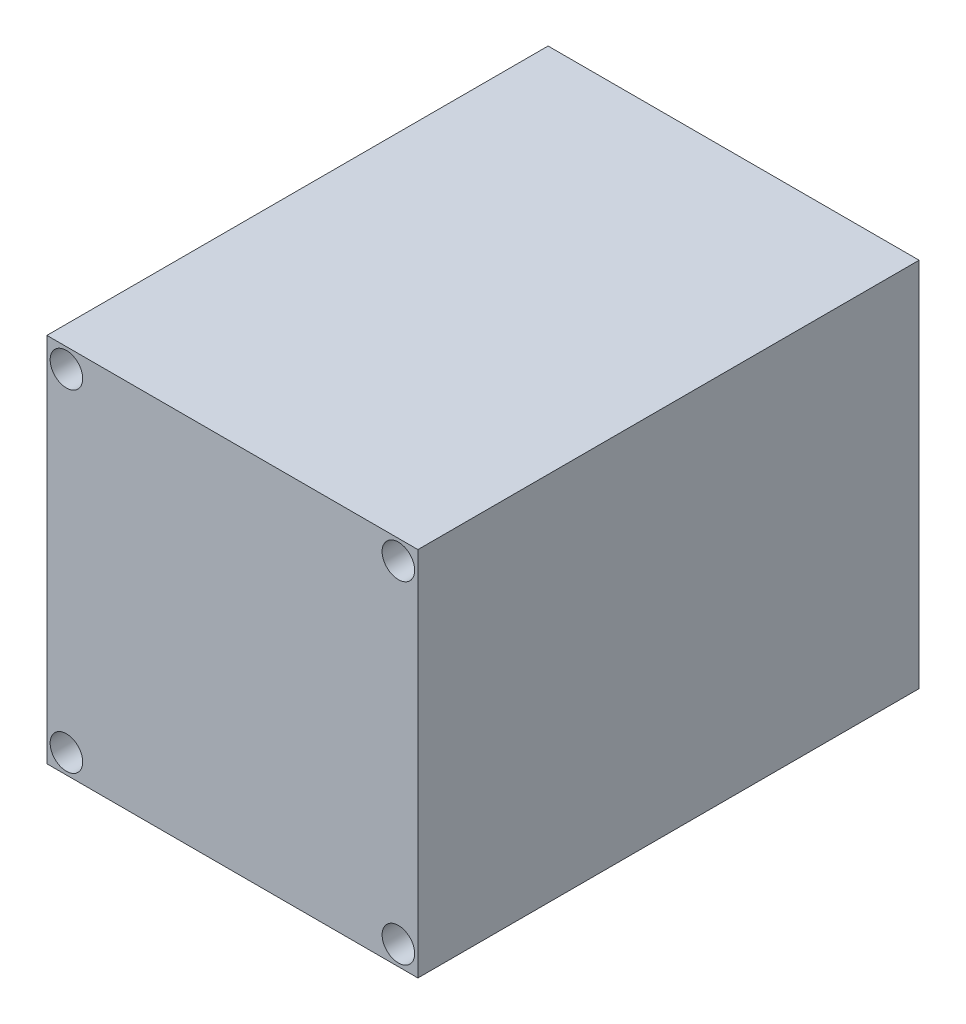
ISO-10303-21;
HEADER;
FILE_DESCRIPTION(('STEP AP214'),'2;1');
FILE_NAME('part.step','',(''),(''),'','','');
FILE_SCHEMA(('AUTOMOTIVE_DESIGN { 1 0 10303 214 1 1 1 1 }'));
ENDSEC;
DATA;
#1=APPLICATION_CONTEXT('core data for automotive mechanical design processes');
#2=APPLICATION_PROTOCOL_DEFINITION('international standard','automotive_design',2000,#1);
#3=PRODUCT_CONTEXT('',#1,'mechanical');
#4=PRODUCT('Part','Part','',(#3));
#5=PRODUCT_RELATED_PRODUCT_CATEGORY('part','',(#4));
#6=PRODUCT_DEFINITION_FORMATION('','',#4);
#7=PRODUCT_DEFINITION_CONTEXT('part definition',#1,'design');
#8=PRODUCT_DEFINITION('design','',#6,#7);
#9=PRODUCT_DEFINITION_SHAPE('','',#8);
#10=(LENGTH_UNIT() NAMED_UNIT(*) SI_UNIT(.MILLI.,.METRE.));
#11=(NAMED_UNIT(*) PLANE_ANGLE_UNIT() SI_UNIT($,.RADIAN.));
#12=(NAMED_UNIT(*) SI_UNIT($,.STERADIAN.) SOLID_ANGLE_UNIT());
#13=UNCERTAINTY_MEASURE_WITH_UNIT(LENGTH_MEASURE(1.E-05),#10,'distance_accuracy_value','');
#14=(GEOMETRIC_REPRESENTATION_CONTEXT(3) GLOBAL_UNCERTAINTY_ASSIGNED_CONTEXT((#13)) GLOBAL_UNIT_ASSIGNED_CONTEXT((#10,
#11,#12)) REPRESENTATION_CONTEXT('',''));
#15=CARTESIAN_POINT('',(0.,0.,0.));
#16=DIRECTION('',(0.,0.,1.));
#17=DIRECTION('',(1.,0.,0.));
#18=AXIS2_PLACEMENT_3D('',#15,#16,#17);
#19=CARTESIAN_POINT('',(0.,0.,77.));
#20=DIRECTION('',(0.,0.,1.));
#21=DIRECTION('',(1.,0.,0.));
#22=AXIS2_PLACEMENT_3D('',#19,#20,#21);
#23=PLANE('',#22);
#24=CARTESIAN_POINT('',(25.5000000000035,-25.4999999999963,77.));
#25=DIRECTION('',(0.,0.,1.));
#26=DIRECTION('',(1.,0.,0.));
#27=AXIS2_PLACEMENT_3D('',#24,#25,#26);
#28=CIRCLE('',#27,2.50000000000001);
#29=CARTESIAN_POINT('',(28.0000000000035,-25.4999999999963,77.));
#30=VERTEX_POINT('',#29);
#31=EDGE_CURVE('E140',#30,#30,#28,.T.);
#32=ORIENTED_EDGE('',*,*,#31,.F.);
#33=EDGE_LOOP('',(#32));
#34=FACE_BOUND('',#33,.T.);
#35=CARTESIAN_POINT('',(-25.4999999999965,25.4999999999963,77.));
#36=DIRECTION('',(0.,0.,1.));
#37=DIRECTION('',(1.,0.,0.));
#38=AXIS2_PLACEMENT_3D('',#35,#36,#37);
#39=CIRCLE('',#38,2.5);
#40=CARTESIAN_POINT('',(-22.9999999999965,25.4999999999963,77.));
#41=VERTEX_POINT('',#40);
#42=EDGE_CURVE('E102',#41,#41,#39,.T.);
#43=ORIENTED_EDGE('',*,*,#42,.F.);
#44=EDGE_LOOP('',(#43));
#45=FACE_BOUND('',#44,.T.);
#46=DIRECTION('',(0.,1.,0.));
#47=VECTOR('',#46,1.);
#48=CARTESIAN_POINT('',(28.5,28.5,77.));
#49=LINE('',#48,#47);
#50=CARTESIAN_POINT('',(28.5,-28.5,77.));
#51=VERTEX_POINT('',#50);
#52=CARTESIAN_POINT('',(28.5,28.5,77.));
#53=VERTEX_POINT('',#52);
#54=EDGE_CURVE('E85',#51,#53,#49,.T.);
#55=ORIENTED_EDGE('',*,*,#54,.T.);
#56=DIRECTION('',(-1.,0.,0.));
#57=VECTOR('',#56,1.);
#58=CARTESIAN_POINT('',(-28.5,28.5,77.));
#59=LINE('',#58,#57);
#60=CARTESIAN_POINT('',(-28.5,28.5,77.));
#61=VERTEX_POINT('',#60);
#62=EDGE_CURVE('E80',#53,#61,#59,.T.);
#63=ORIENTED_EDGE('',*,*,#62,.T.);
#64=DIRECTION('',(0.,-1.,0.));
#65=VECTOR('',#64,1.);
#66=CARTESIAN_POINT('',(-28.5,28.5,77.));
#67=LINE('',#66,#65);
#68=CARTESIAN_POINT('',(-28.5,-28.5,77.));
#69=VERTEX_POINT('',#68);
#70=EDGE_CURVE('E83',#61,#69,#67,.T.);
#71=ORIENTED_EDGE('',*,*,#70,.T.);
#72=DIRECTION('',(1.,0.,0.));
#73=VECTOR('',#72,1.);
#74=CARTESIAN_POINT('',(-28.5,-28.5,77.));
#75=LINE('',#74,#73);
#76=EDGE_CURVE('E49',#69,#51,#75,.T.);
#77=ORIENTED_EDGE('',*,*,#76,.T.);
#78=EDGE_LOOP('',(#55,#63,#71,#77));
#79=FACE_BOUND('',#78,.T.);
#80=CARTESIAN_POINT('',(25.5000000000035,25.4999999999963,77.));
#81=DIRECTION('',(0.,0.,1.));
#82=DIRECTION('',(-1.,0.,0.));
#83=AXIS2_PLACEMENT_3D('',#80,#81,#82);
#84=CIRCLE('',#83,2.50000000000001);
#85=CARTESIAN_POINT('',(23.0000000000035,25.4999999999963,77.));
#86=VERTEX_POINT('',#85);
#87=EDGE_CURVE('E144',#86,#86,#84,.T.);
#88=ORIENTED_EDGE('',*,*,#87,.F.);
#89=EDGE_LOOP('',(#88));
#90=FACE_BOUND('',#89,.T.);
#91=CARTESIAN_POINT('',(-25.4999999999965,-25.4999999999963,77.));
#92=DIRECTION('',(0.,0.,1.));
#93=DIRECTION('',(-1.,0.,0.));
#94=AXIS2_PLACEMENT_3D('',#91,#92,#93);
#95=CIRCLE('',#94,2.5);
#96=CARTESIAN_POINT('',(-27.9999999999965,-25.4999999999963,77.));
#97=VERTEX_POINT('',#96);
#98=EDGE_CURVE('E131',#97,#97,#95,.T.);
#99=ORIENTED_EDGE('',*,*,#98,.F.);
#100=EDGE_LOOP('',(#99));
#101=FACE_BOUND('',#100,.T.);
#102=ADVANCED_FACE('F32',(#34,#45,#79,#90,#101),#23,.T.);
#103=CARTESIAN_POINT('',(0.,0.,0.));
#104=DIRECTION('',(0.,0.,1.));
#105=DIRECTION('',(1.,0.,0.));
#106=AXIS2_PLACEMENT_3D('',#103,#104,#105);
#107=PLANE('',#106);
#108=CARTESIAN_POINT('',(0.,0.,0.));
#109=DIRECTION('',(0.,0.,1.));
#110=DIRECTION('',(1.,0.,0.));
#111=AXIS2_PLACEMENT_3D('',#108,#109,#110);
#112=CIRCLE('',#111,19.);
#113=CARTESIAN_POINT('',(19.,0.,0.));
#114=VERTEX_POINT('',#113);
#115=EDGE_CURVE('E11',#114,#114,#112,.F.);
#116=ORIENTED_EDGE('',*,*,#115,.F.);
#117=EDGE_LOOP('',(#116));
#118=FACE_BOUND('',#117,.T.);
#119=DIRECTION('',(0.,1.,0.));
#120=VECTOR('',#119,1.);
#121=CARTESIAN_POINT('',(28.5,28.5,0.));
#122=LINE('',#121,#120);
#123=CARTESIAN_POINT('',(28.5,-28.5,0.));
#124=VERTEX_POINT('',#123);
#125=CARTESIAN_POINT('',(28.5,28.5,0.));
#126=VERTEX_POINT('',#125);
#127=EDGE_CURVE('E99',#124,#126,#122,.T.);
#128=ORIENTED_EDGE('',*,*,#127,.F.);
#129=DIRECTION('',(1.,0.,0.));
#130=VECTOR('',#129,1.);
#131=CARTESIAN_POINT('',(-28.5,-28.5,0.));
#132=LINE('',#131,#130);
#133=CARTESIAN_POINT('',(-28.5,-28.5,0.));
#134=VERTEX_POINT('',#133);
#135=EDGE_CURVE('E72',#134,#124,#132,.T.);
#136=ORIENTED_EDGE('',*,*,#135,.F.);
#137=DIRECTION('',(0.,-1.,0.));
#138=VECTOR('',#137,1.);
#139=CARTESIAN_POINT('',(-28.5,28.5,0.));
#140=LINE('',#139,#138);
#141=CARTESIAN_POINT('',(-28.5,28.5,0.));
#142=VERTEX_POINT('',#141);
#143=EDGE_CURVE('E66',#142,#134,#140,.T.);
#144=ORIENTED_EDGE('',*,*,#143,.F.);
#145=DIRECTION('',(-1.,0.,0.));
#146=VECTOR('',#145,1.);
#147=CARTESIAN_POINT('',(-28.5,28.5,0.));
#148=LINE('',#147,#146);
#149=EDGE_CURVE('E90',#126,#142,#148,.T.);
#150=ORIENTED_EDGE('',*,*,#149,.F.);
#151=EDGE_LOOP('',(#128,#136,#144,#150));
#152=FACE_BOUND('',#151,.T.);
#153=CARTESIAN_POINT('',(-25.4999999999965,25.4999999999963,0.));
#154=DIRECTION('',(0.,0.,1.));
#155=DIRECTION('',(1.,0.,0.));
#156=AXIS2_PLACEMENT_3D('',#153,#154,#155);
#157=CIRCLE('',#156,2.5);
#158=CARTESIAN_POINT('',(-22.9999999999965,25.4999999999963,0.));
#159=VERTEX_POINT('',#158);
#160=EDGE_CURVE('E118',#159,#159,#157,.T.);
#161=ORIENTED_EDGE('',*,*,#160,.T.);
#162=EDGE_LOOP('',(#161));
#163=FACE_BOUND('',#162,.T.);
#164=CARTESIAN_POINT('',(25.5000000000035,25.4999999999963,0.));
#165=DIRECTION('',(0.,0.,1.));
#166=DIRECTION('',(-1.,0.,0.));
#167=AXIS2_PLACEMENT_3D('',#164,#165,#166);
#168=CIRCLE('',#167,2.50000000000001);
#169=CARTESIAN_POINT('',(23.0000000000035,25.4999999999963,0.));
#170=VERTEX_POINT('',#169);
#171=EDGE_CURVE('E122',#170,#170,#168,.T.);
#172=ORIENTED_EDGE('',*,*,#171,.T.);
#173=EDGE_LOOP('',(#172));
#174=FACE_BOUND('',#173,.T.);
#175=CARTESIAN_POINT('',(25.5000000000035,-25.4999999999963,0.));
#176=DIRECTION('',(0.,0.,1.));
#177=DIRECTION('',(1.,0.,0.));
#178=AXIS2_PLACEMENT_3D('',#175,#176,#177);
#179=CIRCLE('',#178,2.50000000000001);
#180=CARTESIAN_POINT('',(28.0000000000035,-25.4999999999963,0.));
#181=VERTEX_POINT('',#180);
#182=EDGE_CURVE('E126',#181,#181,#179,.T.);
#183=ORIENTED_EDGE('',*,*,#182,.T.);
#184=EDGE_LOOP('',(#183));
#185=FACE_BOUND('',#184,.T.);
#186=CARTESIAN_POINT('',(-25.4999999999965,-25.4999999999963,0.));
#187=DIRECTION('',(0.,0.,1.));
#188=DIRECTION('',(-1.,0.,0.));
#189=AXIS2_PLACEMENT_3D('',#186,#187,#188);
#190=CIRCLE('',#189,2.5);
#191=CARTESIAN_POINT('',(-27.9999999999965,-25.4999999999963,0.));
#192=VERTEX_POINT('',#191);
#193=EDGE_CURVE('E129',#192,#192,#190,.T.);
#194=ORIENTED_EDGE('',*,*,#193,.T.);
#195=EDGE_LOOP('',(#194));
#196=FACE_BOUND('',#195,.T.);
#197=ADVANCED_FACE('F110',(#118,#152,#163,#174,#185,#196),#107,.F.);
#198=CARTESIAN_POINT('',(28.5,28.5,77.));
#199=DIRECTION('',(-1.,0.,0.));
#200=DIRECTION('',(0.,-1.,0.));
#201=AXIS2_PLACEMENT_3D('',#198,#199,#200);
#202=PLANE('',#201);
#203=ORIENTED_EDGE('',*,*,#127,.T.);
#204=DIRECTION('',(0.,0.,-1.));
#205=VECTOR('',#204,1.);
#206=CARTESIAN_POINT('',(28.5,28.5,77.));
#207=LINE('',#206,#205);
#208=EDGE_CURVE('E41',#53,#126,#207,.T.);
#209=ORIENTED_EDGE('',*,*,#208,.F.);
#210=ORIENTED_EDGE('',*,*,#54,.F.);
#211=DIRECTION('',(0.,0.,-1.));
#212=VECTOR('',#211,1.);
#213=CARTESIAN_POINT('',(28.5,-28.5,77.));
#214=LINE('',#213,#212);
#215=EDGE_CURVE('E95',#51,#124,#214,.T.);
#216=ORIENTED_EDGE('',*,*,#215,.T.);
#217=EDGE_LOOP('',(#203,#209,#210,#216));
#218=FACE_BOUND('',#217,.T.);
#219=ADVANCED_FACE('F34',(#218),#202,.F.);
#220=CARTESIAN_POINT('',(-28.5,28.5,77.));
#221=DIRECTION('',(0.,-1.,0.));
#222=DIRECTION('',(0.,0.,-1.));
#223=AXIS2_PLACEMENT_3D('',#220,#221,#222);
#224=PLANE('',#223);
#225=ORIENTED_EDGE('',*,*,#149,.T.);
#226=DIRECTION('',(0.,0.,-1.));
#227=VECTOR('',#226,1.);
#228=CARTESIAN_POINT('',(-28.5,28.5,77.));
#229=LINE('',#228,#227);
#230=EDGE_CURVE('E88',#61,#142,#229,.T.);
#231=ORIENTED_EDGE('',*,*,#230,.F.);
#232=ORIENTED_EDGE('',*,*,#62,.F.);
#233=ORIENTED_EDGE('',*,*,#208,.T.);
#234=EDGE_LOOP('',(#225,#231,#232,#233));
#235=FACE_BOUND('',#234,.T.);
#236=ADVANCED_FACE('F89',(#235),#224,.F.);
#237=CARTESIAN_POINT('',(-28.5,28.5,77.));
#238=DIRECTION('',(1.,0.,0.));
#239=DIRECTION('',(0.,1.,0.));
#240=AXIS2_PLACEMENT_3D('',#237,#238,#239);
#241=PLANE('',#240);
#242=ORIENTED_EDGE('',*,*,#143,.T.);
#243=DIRECTION('',(0.,0.,-1.));
#244=VECTOR('',#243,1.);
#245=CARTESIAN_POINT('',(-28.5,-28.5,77.));
#246=LINE('',#245,#244);
#247=EDGE_CURVE('E91',#69,#134,#246,.T.);
#248=ORIENTED_EDGE('',*,*,#247,.F.);
#249=ORIENTED_EDGE('',*,*,#70,.F.);
#250=ORIENTED_EDGE('',*,*,#230,.T.);
#251=EDGE_LOOP('',(#242,#248,#249,#250));
#252=FACE_BOUND('',#251,.T.);
#253=ADVANCED_FACE('F93',(#252),#241,.F.);
#254=CARTESIAN_POINT('',(-28.5,-28.5,77.));
#255=DIRECTION('',(0.,1.,0.));
#256=DIRECTION('',(0.,0.,1.));
#257=AXIS2_PLACEMENT_3D('',#254,#255,#256);
#258=PLANE('',#257);
#259=ORIENTED_EDGE('',*,*,#135,.T.);
#260=ORIENTED_EDGE('',*,*,#215,.F.);
#261=ORIENTED_EDGE('',*,*,#76,.F.);
#262=ORIENTED_EDGE('',*,*,#247,.T.);
#263=EDGE_LOOP('',(#259,#260,#261,#262));
#264=FACE_BOUND('',#263,.T.);
#265=ADVANCED_FACE('F164',(#264),#258,.F.);
#266=CARTESIAN_POINT('',(-25.4999999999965,25.4999999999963,77.));
#267=DIRECTION('',(0.,0.,-1.));
#268=DIRECTION('',(-1.,0.,0.));
#269=AXIS2_PLACEMENT_3D('',#266,#267,#268);
#270=CYLINDRICAL_SURFACE('',#269,2.5);
#271=ORIENTED_EDGE('',*,*,#42,.T.);
#272=EDGE_LOOP('',(#271));
#273=FACE_BOUND('',#272,.T.);
#274=ORIENTED_EDGE('',*,*,#160,.F.);
#275=EDGE_LOOP('',(#274));
#276=FACE_BOUND('',#275,.T.);
#277=ADVANCED_FACE('F152',(#273,#276),#270,.F.);
#278=CARTESIAN_POINT('',(25.5000000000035,25.4999999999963,77.));
#279=DIRECTION('',(0.,0.,-1.));
#280=DIRECTION('',(-1.,0.,0.));
#281=AXIS2_PLACEMENT_3D('',#278,#279,#280);
#282=CYLINDRICAL_SURFACE('',#281,2.50000000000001);
#283=ORIENTED_EDGE('',*,*,#87,.T.);
#284=EDGE_LOOP('',(#283));
#285=FACE_BOUND('',#284,.T.);
#286=ORIENTED_EDGE('',*,*,#171,.F.);
#287=EDGE_LOOP('',(#286));
#288=FACE_BOUND('',#287,.T.);
#289=ADVANCED_FACE('F235',(#285,#288),#282,.F.);
#290=CARTESIAN_POINT('',(25.5000000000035,-25.4999999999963,77.));
#291=DIRECTION('',(0.,0.,-1.));
#292=DIRECTION('',(-1.,0.,0.));
#293=AXIS2_PLACEMENT_3D('',#290,#291,#292);
#294=CYLINDRICAL_SURFACE('',#293,2.50000000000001);
#295=ORIENTED_EDGE('',*,*,#31,.T.);
#296=EDGE_LOOP('',(#295));
#297=FACE_BOUND('',#296,.T.);
#298=ORIENTED_EDGE('',*,*,#182,.F.);
#299=EDGE_LOOP('',(#298));
#300=FACE_BOUND('',#299,.T.);
#301=ADVANCED_FACE('F232',(#297,#300),#294,.F.);
#302=CARTESIAN_POINT('',(-25.4999999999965,-25.4999999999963,77.));
#303=DIRECTION('',(0.,0.,-1.));
#304=DIRECTION('',(-1.,0.,0.));
#305=AXIS2_PLACEMENT_3D('',#302,#303,#304);
#306=CYLINDRICAL_SURFACE('',#305,2.5);
#307=ORIENTED_EDGE('',*,*,#98,.T.);
#308=EDGE_LOOP('',(#307));
#309=FACE_BOUND('',#308,.T.);
#310=ORIENTED_EDGE('',*,*,#193,.F.);
#311=EDGE_LOOP('',(#310));
#312=FACE_BOUND('',#311,.T.);
#313=ADVANCED_FACE('F185',(#309,#312),#306,.F.);
#314=CARTESIAN_POINT('',(0.,0.,-2.));
#315=DIRECTION('',(0.,0.,1.));
#316=DIRECTION('',(1.,0.,0.));
#317=AXIS2_PLACEMENT_3D('',#314,#315,#316);
#318=CYLINDRICAL_SURFACE('',#317,19.);
#319=CARTESIAN_POINT('',(0.,0.,-2.));
#320=DIRECTION('',(0.,0.,-1.));
#321=DIRECTION('',(-1.,0.,0.));
#322=AXIS2_PLACEMENT_3D('',#319,#320,#321);
#323=CIRCLE('',#322,19.);
#324=CARTESIAN_POINT('',(-19.,0.,-2.));
#325=VERTEX_POINT('',#324);
#326=EDGE_CURVE('E132',#325,#325,#323,.T.);
#327=ORIENTED_EDGE('',*,*,#326,.F.);
#328=EDGE_LOOP('',(#327));
#329=FACE_BOUND('',#328,.T.);
#330=ORIENTED_EDGE('',*,*,#115,.T.);
#331=EDGE_LOOP('',(#330));
#332=FACE_BOUND('',#331,.T.);
#333=ADVANCED_FACE('F190',(#329,#332),#318,.T.);
#334=CARTESIAN_POINT('',(0.,0.,-2.));
#335=DIRECTION('',(0.,0.,-1.));
#336=DIRECTION('',(-1.,0.,0.));
#337=AXIS2_PLACEMENT_3D('',#334,#335,#336);
#338=PLANE('',#337);
#339=CARTESIAN_POINT('',(0.,0.,-2.));
#340=DIRECTION('',(0.,0.,-1.));
#341=DIRECTION('',(-1.,0.,0.));
#342=AXIS2_PLACEMENT_3D('',#339,#340,#341);
#343=CIRCLE('',#342,3.2);
#344=CARTESIAN_POINT('',(3.2,0.,-2.));
#345=VERTEX_POINT('',#344);
#346=EDGE_CURVE('E284',#345,#345,#343,.T.);
#347=ORIENTED_EDGE('',*,*,#346,.F.);
#348=EDGE_LOOP('',(#347));
#349=FACE_BOUND('',#348,.T.);
#350=ORIENTED_EDGE('',*,*,#326,.T.);
#351=EDGE_LOOP('',(#350));
#352=FACE_BOUND('',#351,.T.);
#353=ADVANCED_FACE('F195',(#349,#352),#338,.T.);
#354=CARTESIAN_POINT('',(0.,0.,-23.));
#355=DIRECTION('',(0.,0.,1.));
#356=DIRECTION('',(1.,0.,0.));
#357=AXIS2_PLACEMENT_3D('',#354,#355,#356);
#358=CYLINDRICAL_SURFACE('',#357,3.2);
#359=CARTESIAN_POINT('',(0.,0.,-23.));
#360=DIRECTION('',(0.,0.,-1.));
#361=DIRECTION('',(-1.,0.,0.));
#362=AXIS2_PLACEMENT_3D('',#359,#360,#361);
#363=CIRCLE('',#362,3.2);
#364=CARTESIAN_POINT('',(3.2,0.,-23.));
#365=VERTEX_POINT('',#364);
#366=EDGE_CURVE('E137',#365,#365,#363,.T.);
#367=CARTESIAN_POINT('',(3.2,0.,-23.));
#368=CARTESIAN_POINT('',(3.2,0.,-22.78125));
#369=CARTESIAN_POINT('',(3.2,0.,-22.5625));
#370=CARTESIAN_POINT('',(3.2,0.,-22.125));
#371=CARTESIAN_POINT('',(3.2,0.,-21.90625));
#372=CARTESIAN_POINT('',(3.2,0.,-21.46875));
#373=CARTESIAN_POINT('',(3.2,0.,-21.25));
#374=CARTESIAN_POINT('',(3.2,0.,-20.8125));
#375=CARTESIAN_POINT('',(3.2,0.,-20.59375));
#376=CARTESIAN_POINT('',(3.2,0.,-20.15625));
#377=CARTESIAN_POINT('',(3.2,0.,-19.9375));
#378=CARTESIAN_POINT('',(3.2,0.,-19.5));
#379=CARTESIAN_POINT('',(3.2,0.,-19.28125));
#380=CARTESIAN_POINT('',(3.2,0.,-18.84375));
#381=CARTESIAN_POINT('',(3.2,0.,-18.625));
#382=CARTESIAN_POINT('',(3.2,0.,-18.1875));
#383=CARTESIAN_POINT('',(3.2,0.,-17.96875));
#384=CARTESIAN_POINT('',(3.2,0.,-17.53125));
#385=CARTESIAN_POINT('',(3.2,0.,-17.3125));
#386=CARTESIAN_POINT('',(3.2,0.,-16.875));
#387=CARTESIAN_POINT('',(3.2,0.,-16.65625));
#388=CARTESIAN_POINT('',(3.2,0.,-16.21875));
#389=CARTESIAN_POINT('',(3.2,0.,-16.));
#390=CARTESIAN_POINT('',(3.2,0.,-15.5625));
#391=CARTESIAN_POINT('',(3.2,0.,-15.34375));
#392=CARTESIAN_POINT('',(3.2,0.,-14.90625));
#393=CARTESIAN_POINT('',(3.2,0.,-14.6875));
#394=CARTESIAN_POINT('',(3.2,0.,-14.25));
#395=CARTESIAN_POINT('',(3.2,0.,-14.03125));
#396=CARTESIAN_POINT('',(3.2,0.,-13.59375));
#397=CARTESIAN_POINT('',(3.2,0.,-13.375));
#398=CARTESIAN_POINT('',(3.2,0.,-12.9375));
#399=CARTESIAN_POINT('',(3.2,0.,-12.71875));
#400=CARTESIAN_POINT('',(3.2,0.,-12.28125));
#401=CARTESIAN_POINT('',(3.2,0.,-12.0625));
#402=CARTESIAN_POINT('',(3.2,0.,-11.625));
#403=CARTESIAN_POINT('',(3.2,0.,-11.40625));
#404=CARTESIAN_POINT('',(3.2,0.,-10.96875));
#405=CARTESIAN_POINT('',(3.2,0.,-10.75));
#406=CARTESIAN_POINT('',(3.2,0.,-10.3125));
#407=CARTESIAN_POINT('',(3.2,0.,-10.09375));
#408=CARTESIAN_POINT('',(3.2,0.,-9.65625));
#409=CARTESIAN_POINT('',(3.2,0.,-9.4375));
#410=CARTESIAN_POINT('',(3.2,0.,-9.));
#411=CARTESIAN_POINT('',(3.2,0.,-8.78125));
#412=CARTESIAN_POINT('',(3.2,0.,-8.34375));
#413=CARTESIAN_POINT('',(3.2,0.,-8.125));
#414=CARTESIAN_POINT('',(3.2,0.,-7.6875));
#415=CARTESIAN_POINT('',(3.2,0.,-7.46875));
#416=CARTESIAN_POINT('',(3.2,0.,-7.03125));
#417=CARTESIAN_POINT('',(3.2,0.,-6.8125));
#418=CARTESIAN_POINT('',(3.2,0.,-6.375));
#419=CARTESIAN_POINT('',(3.2,0.,-6.15625));
#420=CARTESIAN_POINT('',(3.2,0.,-5.71875));
#421=CARTESIAN_POINT('',(3.2,0.,-5.5));
#422=CARTESIAN_POINT('',(3.2,0.,-5.0625));
#423=CARTESIAN_POINT('',(3.2,0.,-4.84375));
#424=CARTESIAN_POINT('',(3.2,0.,-4.40625));
#425=CARTESIAN_POINT('',(3.2,0.,-4.1875));
#426=CARTESIAN_POINT('',(3.2,0.,-3.75));
#427=CARTESIAN_POINT('',(3.2,0.,-3.53125));
#428=CARTESIAN_POINT('',(3.2,0.,-3.09375));
#429=CARTESIAN_POINT('',(3.2,0.,-2.875));
#430=CARTESIAN_POINT('',(3.2,0.,-2.4375));
#431=CARTESIAN_POINT('',(3.2,0.,-2.21875));
#432=CARTESIAN_POINT('',(3.2,0.,-2.));
#433=B_SPLINE_CURVE_WITH_KNOTS('',3,(#367,#368,#369,#370,#371,#372,#373,#374,#375,#376,#377,
#378,#379,#380,#381,#382,#383,#384,#385,#386,#387,#388,#389,#390,#391,#392,#393,#394,#395,#396,
#397,#398,#399,#400,#401,#402,#403,#404,#405,#406,#407,#408,#409,#410,#411,#412,#413,#414,#415,
#416,#417,#418,#419,#420,#421,#422,#423,#424,#425,#426,#427,#428,#429,#430,#431,#432),
.UNSPECIFIED.,.F.,.F.,(4,2,2,2,2,2,2,2,2,2,2,2,2,2,2,2,2,2,2,2,2,2,2,2,2,2,2,2,2,2,2,2,4),(0.,
0.656249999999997,1.3125,1.96875,2.625,3.28125,3.9375,4.59375,5.25,5.90625,6.5625,7.21875,7.875,
8.53125,9.1875,9.84375,10.5,11.15625,11.8125,12.46875,13.125,13.78125,14.4375,15.09375,15.75,
16.40625,17.0625,17.71875,18.375,19.03125,19.6875,20.34375,21.),.UNSPECIFIED.);
#434=EDGE_CURVE('BSEAM205',#365,#345,#433,.T.);
#435=ORIENTED_EDGE('',*,*,#366,.F.);
#436=ORIENTED_EDGE('',*,*,#346,.T.);
#437=ORIENTED_EDGE('',*,*,#434,.T.);
#438=ORIENTED_EDGE('',*,*,#434,.F.);
#439=EDGE_LOOP('',(#435,#437,#436,#438));
#440=FACE_BOUND('',#439,.T.);
#441=ADVANCED_FACE('F205',(#440),#358,.T.);
#442=CARTESIAN_POINT('',(0.,0.,-23.));
#443=DIRECTION('',(0.,0.,-1.));
#444=DIRECTION('',(-1.,0.,0.));
#445=AXIS2_PLACEMENT_3D('',#442,#443,#444);
#446=PLANE('',#445);
#447=ORIENTED_EDGE('',*,*,#366,.T.);
#448=EDGE_LOOP('',(#447));
#449=FACE_BOUND('',#448,.T.);
#450=ADVANCED_FACE('F215',(#449),#446,.T.);
#451=CLOSED_SHELL('',(#102,#197,#219,#236,#253,#265,#277,#289,#301,#313,#333,#353,#441,#450));
#452=MANIFOLD_SOLID_BREP('B2',#451);
#453=ADVANCED_BREP_SHAPE_REPRESENTATION('',(#18,#452),#14);
#454=SHAPE_DEFINITION_REPRESENTATION(#9,#453);
ENDSEC;
END-ISO-10303-21;
